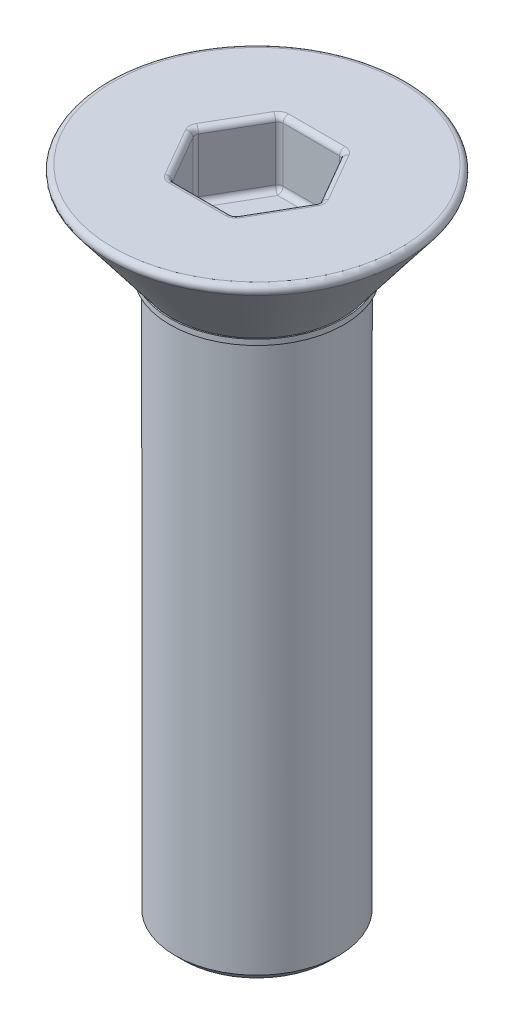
ISO-10303-21;
HEADER;
FILE_DESCRIPTION(('STEP AP214'),'2;1');
FILE_NAME('part.step','',(''),(''),'','','');
FILE_SCHEMA(('AUTOMOTIVE_DESIGN { 1 0 10303 214 1 1 1 1 }'));
ENDSEC;
DATA;
#1=APPLICATION_CONTEXT('core data for automotive mechanical design processes');
#2=APPLICATION_PROTOCOL_DEFINITION('international standard','automotive_design',2000,#1);
#3=PRODUCT_CONTEXT('',#1,'mechanical');
#4=PRODUCT('Part','Part','',(#3));
#5=PRODUCT_RELATED_PRODUCT_CATEGORY('part','',(#4));
#6=PRODUCT_DEFINITION_FORMATION('','',#4);
#7=PRODUCT_DEFINITION_CONTEXT('part definition',#1,'design');
#8=PRODUCT_DEFINITION('design','',#6,#7);
#9=PRODUCT_DEFINITION_SHAPE('','',#8);
#10=(LENGTH_UNIT() NAMED_UNIT(*) SI_UNIT(.MILLI.,.METRE.));
#11=(NAMED_UNIT(*) PLANE_ANGLE_UNIT() SI_UNIT($,.RADIAN.));
#12=(NAMED_UNIT(*) SI_UNIT($,.STERADIAN.) SOLID_ANGLE_UNIT());
#13=UNCERTAINTY_MEASURE_WITH_UNIT(LENGTH_MEASURE(1.E-05),#10,'distance_accuracy_value','');
#14=(GEOMETRIC_REPRESENTATION_CONTEXT(3) GLOBAL_UNCERTAINTY_ASSIGNED_CONTEXT((#13)) GLOBAL_UNIT_ASSIGNED_CONTEXT((#10,
#11,#12)) REPRESENTATION_CONTEXT('',''));
#15=CARTESIAN_POINT('',(0.,0.,0.));
#16=DIRECTION('',(0.,0.,1.));
#17=DIRECTION('',(1.,0.,0.));
#18=AXIS2_PLACEMENT_3D('',#15,#16,#17);
#19=CARTESIAN_POINT('',(0.,0.1,0.));
#20=DIRECTION('',(0.,-1.,0.));
#21=DIRECTION('',(0.,0.,-1.));
#22=AXIS2_PLACEMENT_3D('',#19,#20,#21);
#23=CYLINDRICAL_SURFACE('',#22,1.6);
#24=CARTESIAN_POINT('',(0.,0.1,0.));
#25=DIRECTION('',(0.,1.,0.));
#26=DIRECTION('',(0.,0.,1.));
#27=AXIS2_PLACEMENT_3D('',#24,#25,#26);
#28=CIRCLE('',#27,1.6);
#29=CARTESIAN_POINT('',(0.,0.0999999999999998,1.6));
#30=VERTEX_POINT('',#29);
#31=EDGE_CURVE('E11',#30,#30,#28,.T.);
#32=ORIENTED_EDGE('',*,*,#31,.F.);
#33=EDGE_LOOP('',(#32));
#34=FACE_BOUND('',#33,.T.);
#35=CARTESIAN_POINT('',(0.,0.,0.));
#36=DIRECTION('',(0.,1.,0.));
#37=DIRECTION('',(0.,0.,1.));
#38=AXIS2_PLACEMENT_3D('',#35,#36,#37);
#39=CIRCLE('',#38,1.6);
#40=CARTESIAN_POINT('',(0.,0.,1.6));
#41=VERTEX_POINT('',#40);
#42=EDGE_CURVE('E48',#41,#41,#39,.T.);
#43=ORIENTED_EDGE('',*,*,#42,.T.);
#44=EDGE_LOOP('',(#43));
#45=FACE_BOUND('',#44,.T.);
#46=ADVANCED_FACE('F45',(#34,#45),#23,.T.);
#47=CARTESIAN_POINT('',(0.,0.1,0.));
#48=DIRECTION('',(0.,1.,0.));
#49=DIRECTION('',(0.,0.,1.));
#50=AXIS2_PLACEMENT_3D('',#47,#48,#49);
#51=PLANE('',#50);
#52=ORIENTED_EDGE('',*,*,#31,.T.);
#53=EDGE_LOOP('',(#52));
#54=FACE_BOUND('',#53,.T.);
#55=ADVANCED_FACE('F60',(#54),#51,.T.);
#56=CARTESIAN_POINT('',(0.,0.,0.));
#57=DIRECTION('',(0.,1.,0.));
#58=DIRECTION('',(0.,0.,1.));
#59=AXIS2_PLACEMENT_3D('',#56,#57,#58);
#60=PLANE('',#59);
#61=ORIENTED_EDGE('',*,*,#42,.F.);
#62=EDGE_LOOP('',(#61));
#63=FACE_BOUND('',#62,.T.);
#64=ADVANCED_FACE('F58',(#63),#60,.F.);
#65=CLOSED_SHELL('',(#46,#55,#64));
#66=MANIFOLD_SOLID_BREP('B2',#65);
#67=CARTESIAN_POINT('',(0.,1.75,2.845));
#68=DIRECTION('',(0.,1.,0.));
#69=DIRECTION('',(0.,0.,1.));
#70=AXIS2_PLACEMENT_3D('',#67,#68,#69);
#71=PLANE('',#70);
#72=CARTESIAN_POINT('',(0.,1.75,0.));
#73=DIRECTION('',(0.,1.,0.));
#74=DIRECTION('',(0.,0.,1.));
#75=AXIS2_PLACEMENT_3D('',#72,#73,#74);
#76=CIRCLE('',#75,2.6420198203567);
#77=CARTESIAN_POINT('',(0.,1.75,2.6420198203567));
#78=VERTEX_POINT('',#77);
#79=EDGE_CURVE('E288',#78,#78,#76,.T.);
#80=ORIENTED_EDGE('',*,*,#79,.T.);
#81=EDGE_LOOP('',(#80));
#82=FACE_BOUND('',#81,.T.);
#83=CARTESIAN_POINT('',(0.519615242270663,1.75,0.9));
#84=DIRECTION('',(0.,1.,0.));
#85=DIRECTION('',(0.,0.,1.));
#86=AXIS2_PLACEMENT_3D('',#83,#84,#85);
#87=CIRCLE('',#86,0.2);
#88=CARTESIAN_POINT('',(0.519615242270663,1.75,1.1));
#89=VERTEX_POINT('',#88);
#90=CARTESIAN_POINT('',(0.692820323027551,1.75,1.));
#91=VERTEX_POINT('',#90);
#92=EDGE_CURVE('E318',#89,#91,#87,.T.);
#93=ORIENTED_EDGE('',*,*,#92,.F.);
#94=DIRECTION('',(1.,0.,0.));
#95=VECTOR('',#94,1.);
#96=CARTESIAN_POINT('',(-0.577350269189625,1.75,1.1));
#97=LINE('',#96,#95);
#98=CARTESIAN_POINT('',(-0.519615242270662,1.75,1.1));
#99=VERTEX_POINT('',#98);
#100=EDGE_CURVE('E316',#89,#99,#97,.F.);
#101=ORIENTED_EDGE('',*,*,#100,.T.);
#102=CARTESIAN_POINT('',(-0.519615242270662,1.75,0.900000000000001));
#103=DIRECTION('',(0.,1.,0.));
#104=DIRECTION('',(0.,0.,1.));
#105=AXIS2_PLACEMENT_3D('',#102,#103,#104);
#106=CIRCLE('',#105,0.2);
#107=CARTESIAN_POINT('',(-0.69282032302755,1.75,1.));
#108=VERTEX_POINT('',#107);
#109=EDGE_CURVE('E313',#108,#99,#106,.T.);
#110=ORIENTED_EDGE('',*,*,#109,.F.);
#111=DIRECTION('',(0.5,0.,0.866025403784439));
#112=VECTOR('',#111,1.);
#113=CARTESIAN_POINT('',(-1.2413030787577,1.75,0.0500000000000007));
#114=LINE('',#113,#112);
#115=CARTESIAN_POINT('',(-1.21243556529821,1.75,0.100000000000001));
#116=VERTEX_POINT('',#115);
#117=EDGE_CURVE('E305',#108,#116,#114,.F.);
#118=ORIENTED_EDGE('',*,*,#117,.T.);
#119=CARTESIAN_POINT('',(-1.03923048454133,1.75,0.));
#120=DIRECTION('',(0.,1.,0.));
#121=DIRECTION('',(0.,0.,1.));
#122=AXIS2_PLACEMENT_3D('',#119,#120,#121);
#123=CIRCLE('',#122,0.2);
#124=CARTESIAN_POINT('',(-1.21243556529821,1.75,-0.0999999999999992));
#125=VERTEX_POINT('',#124);
#126=EDGE_CURVE('E303',#125,#116,#123,.T.);
#127=ORIENTED_EDGE('',*,*,#126,.F.);
#128=DIRECTION('',(-0.5,0.,0.866025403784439));
#129=VECTOR('',#128,1.);
#130=CARTESIAN_POINT('',(-0.66395280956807,1.75,-1.05));
#131=LINE('',#130,#129);
#132=CARTESIAN_POINT('',(-0.692820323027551,1.75,-1.));
#133=VERTEX_POINT('',#132);
#134=EDGE_CURVE('E299',#125,#133,#131,.F.);
#135=ORIENTED_EDGE('',*,*,#134,.T.);
#136=CARTESIAN_POINT('',(-0.519615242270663,1.75,-0.9));
#137=DIRECTION('',(0.,1.,0.));
#138=DIRECTION('',(0.,0.,1.));
#139=AXIS2_PLACEMENT_3D('',#136,#137,#138);
#140=CIRCLE('',#139,0.2);
#141=CARTESIAN_POINT('',(-0.519615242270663,1.75,-1.1));
#142=VERTEX_POINT('',#141);
#143=EDGE_CURVE('E296',#142,#133,#140,.T.);
#144=ORIENTED_EDGE('',*,*,#143,.F.);
#145=DIRECTION('',(-1.,0.,0.));
#146=VECTOR('',#145,1.);
#147=CARTESIAN_POINT('',(0.577350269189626,1.75,-1.1));
#148=LINE('',#147,#146);
#149=CARTESIAN_POINT('',(0.519615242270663,1.75,-1.1));
#150=VERTEX_POINT('',#149);
#151=EDGE_CURVE('E294',#142,#150,#148,.F.);
#152=ORIENTED_EDGE('',*,*,#151,.T.);
#153=CARTESIAN_POINT('',(0.519615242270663,1.75,-0.9));
#154=DIRECTION('',(0.,1.,0.));
#155=DIRECTION('',(0.,0.,1.));
#156=AXIS2_PLACEMENT_3D('',#153,#154,#155);
#157=CIRCLE('',#156,0.2);
#158=CARTESIAN_POINT('',(0.692820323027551,1.75,-1.));
#159=VERTEX_POINT('',#158);
#160=EDGE_CURVE('E291',#159,#150,#157,.T.);
#161=ORIENTED_EDGE('',*,*,#160,.F.);
#162=DIRECTION('',(-0.5,0.,-0.866025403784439));
#163=VECTOR('',#162,1.);
#164=CARTESIAN_POINT('',(1.2413030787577,1.75,-0.0500000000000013));
#165=LINE('',#164,#163);
#166=CARTESIAN_POINT('',(1.21243556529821,1.75,-0.100000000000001));
#167=VERTEX_POINT('',#166);
#168=EDGE_CURVE('E301',#159,#167,#165,.F.);
#169=ORIENTED_EDGE('',*,*,#168,.T.);
#170=CARTESIAN_POINT('',(1.03923048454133,1.75,0.));
#171=DIRECTION('',(0.,1.,0.));
#172=DIRECTION('',(0.,0.,1.));
#173=AXIS2_PLACEMENT_3D('',#170,#171,#172);
#174=CIRCLE('',#173,0.2);
#175=CARTESIAN_POINT('',(1.21243556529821,1.75,0.099999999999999));
#176=VERTEX_POINT('',#175);
#177=EDGE_CURVE('E308',#176,#167,#174,.T.);
#178=ORIENTED_EDGE('',*,*,#177,.F.);
#179=DIRECTION('',(0.499999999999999,0.,-0.866025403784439));
#180=VECTOR('',#179,1.);
#181=CARTESIAN_POINT('',(0.66395280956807,1.75,1.05));
#182=LINE('',#181,#180);
#183=EDGE_CURVE('E311',#176,#91,#182,.F.);
#184=ORIENTED_EDGE('',*,*,#183,.T.);
#185=EDGE_LOOP('',(#93,#101,#110,#118,#127,#135,#144,#152,#161,#169,#178,#184));
#186=FACE_BOUND('',#185,.T.);
#187=ADVANCED_FACE('F86',(#82,#186),#71,.T.);
#188=CARTESIAN_POINT('',(0.,-10.25,0.));
#189=DIRECTION('',(0.,-1.,0.));
#190=DIRECTION('',(0.,0.,-1.));
#191=AXIS2_PLACEMENT_3D('',#188,#189,#190);
#192=PLANE('',#191);
#193=CARTESIAN_POINT('',(0.,-10.25,0.));
#194=DIRECTION('',(0.,-1.,0.));
#195=DIRECTION('',(0.,0.,-1.));
#196=AXIS2_PLACEMENT_3D('',#193,#194,#195);
#197=CIRCLE('',#196,1.35000000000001);
#198=CARTESIAN_POINT('',(0.,-10.25,-1.35000000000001));
#199=VERTEX_POINT('',#198);
#200=EDGE_CURVE('E265',#199,#199,#197,.T.);
#201=ORIENTED_EDGE('',*,*,#200,.T.);
#202=EDGE_LOOP('',(#201));
#203=FACE_BOUND('',#202,.T.);
#204=ADVANCED_FACE('F480',(#203),#192,.T.);
#205=CARTESIAN_POINT('',(0.,1.75,0.));
#206=DIRECTION('',(0.,1.,0.));
#207=DIRECTION('',(0.,0.,1.));
#208=AXIS2_PLACEMENT_3D('',#205,#206,#207);
#209=CYLINDRICAL_SURFACE('',#208,1.5);
#210=CARTESIAN_POINT('',(0.,-10.1,0.));
#211=DIRECTION('',(0.,-1.,0.));
#212=DIRECTION('',(0.,0.,-1.));
#213=AXIS2_PLACEMENT_3D('',#210,#211,#212);
#214=CIRCLE('',#213,1.5);
#215=CARTESIAN_POINT('',(0.,-10.1,-1.5));
#216=VERTEX_POINT('',#215);
#217=EDGE_CURVE('E269',#216,#216,#214,.F.);
#218=ORIENTED_EDGE('',*,*,#217,.T.);
#219=EDGE_LOOP('',(#218));
#220=FACE_BOUND('',#219,.T.);
#221=CARTESIAN_POINT('',(0.,0.,0.));
#222=DIRECTION('',(0.,1.,0.));
#223=DIRECTION('',(0.,0.,1.));
#224=AXIS2_PLACEMENT_3D('',#221,#222,#223);
#225=CIRCLE('',#224,1.5);
#226=CARTESIAN_POINT('',(0.,0.,1.5));
#227=VERTEX_POINT('',#226);
#228=EDGE_CURVE('E449',#227,#227,#225,.T.);
#229=ORIENTED_EDGE('',*,*,#228,.F.);
#230=EDGE_LOOP('',(#229));
#231=FACE_BOUND('',#230,.T.);
#232=ADVANCED_FACE('F460',(#220,#231),#209,.T.);
#233=CARTESIAN_POINT('',(0.,1.75,0.));
#234=DIRECTION('',(0.,1.,0.));
#235=DIRECTION('',(0.,0.,1.));
#236=AXIS2_PLACEMENT_3D('',#233,#234,#235);
#237=CONICAL_SURFACE('',#236,2.845,0.655281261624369);
#238=CARTESIAN_POINT('',(0.,1.58906177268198,0.));
#239=DIRECTION('',(0.,-1.,0.));
#240=DIRECTION('',(0.,0.,-1.));
#241=AXIS2_PLACEMENT_3D('',#238,#239,#240);
#242=CIRCLE('',#241,2.72130747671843);
#243=CARTESIAN_POINT('',(0.,1.58906177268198,-2.72130747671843));
#244=VERTEX_POINT('',#243);
#245=EDGE_CURVE('E43',#244,#244,#242,.T.);
#246=ORIENTED_EDGE('',*,*,#245,.T.);
#247=EDGE_LOOP('',(#246));
#248=FACE_BOUND('',#247,.T.);
#249=ORIENTED_EDGE('',*,*,#228,.T.);
#250=EDGE_LOOP('',(#249));
#251=FACE_BOUND('',#250,.T.);
#252=ADVANCED_FACE('F492',(#248,#251),#237,.T.);
#253=CARTESIAN_POINT('',(0.577350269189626,0.550000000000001,1.));
#254=DIRECTION('',(0.866025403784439,0.,0.499999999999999));
#255=DIRECTION('',(0.499999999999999,0.,-0.866025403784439));
#256=AXIS2_PLACEMENT_3D('',#253,#254,#255);
#257=PLANE('',#256);
#258=DIRECTION('',(0.499999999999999,0.,-0.866025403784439));
#259=VECTOR('',#258,1.);
#260=CARTESIAN_POINT('',(0.577350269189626,0.650000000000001,1.));
#261=LINE('',#260,#259);
#262=CARTESIAN_POINT('',(1.12583302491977,0.650000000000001,0.049999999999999));
#263=VERTEX_POINT('',#262);
#264=CARTESIAN_POINT('',(0.606217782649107,0.650000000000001,0.95));
#265=VERTEX_POINT('',#264);
#266=EDGE_CURVE('E334',#263,#265,#261,.F.);
#267=ORIENTED_EDGE('',*,*,#266,.T.);
#268=DIRECTION('',(0.,1.,0.));
#269=VECTOR('',#268,1.);
#270=CARTESIAN_POINT('',(0.606217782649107,1.75,0.95));
#271=LINE('',#270,#269);
#272=CARTESIAN_POINT('',(0.606217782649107,1.65,0.95));
#273=VERTEX_POINT('',#272);
#274=EDGE_CURVE('E336',#265,#273,#271,.T.);
#275=ORIENTED_EDGE('',*,*,#274,.T.);
#276=DIRECTION('',(0.499999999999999,0.,-0.866025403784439));
#277=VECTOR('',#276,1.);
#278=CARTESIAN_POINT('',(1.15470053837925,1.65,0.));
#279=LINE('',#278,#277);
#280=CARTESIAN_POINT('',(1.12583302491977,1.65,0.0499999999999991));
#281=VERTEX_POINT('',#280);
#282=EDGE_CURVE('E332',#273,#281,#279,.T.);
#283=ORIENTED_EDGE('',*,*,#282,.T.);
#284=DIRECTION('',(0.,1.,0.));
#285=VECTOR('',#284,1.);
#286=CARTESIAN_POINT('',(1.12583302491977,0.550000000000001,0.049999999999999));
#287=LINE('',#286,#285);
#288=EDGE_CURVE('E330',#281,#263,#287,.F.);
#289=ORIENTED_EDGE('',*,*,#288,.T.);
#290=EDGE_LOOP('',(#267,#275,#283,#289));
#291=FACE_BOUND('',#290,.T.);
#292=ADVANCED_FACE('F490',(#291),#257,.F.);
#293=CARTESIAN_POINT('',(-0.577350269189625,0.550000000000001,1.));
#294=DIRECTION('',(0.,0.,1.));
#295=DIRECTION('',(1.,0.,0.));
#296=AXIS2_PLACEMENT_3D('',#293,#294,#295);
#297=PLANE('',#296);
#298=DIRECTION('',(1.,0.,0.));
#299=VECTOR('',#298,1.);
#300=CARTESIAN_POINT('',(-0.577350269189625,0.650000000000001,1.));
#301=LINE('',#300,#299);
#302=CARTESIAN_POINT('',(0.519615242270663,0.650000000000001,1.));
#303=VERTEX_POINT('',#302);
#304=CARTESIAN_POINT('',(-0.519615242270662,0.650000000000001,1.));
#305=VERTEX_POINT('',#304);
#306=EDGE_CURVE('E325',#303,#305,#301,.F.);
#307=ORIENTED_EDGE('',*,*,#306,.T.);
#308=DIRECTION('',(0.,1.,0.));
#309=VECTOR('',#308,1.);
#310=CARTESIAN_POINT('',(-0.519615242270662,1.75,1.));
#311=LINE('',#310,#309);
#312=CARTESIAN_POINT('',(-0.519615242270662,1.65,1.));
#313=VERTEX_POINT('',#312);
#314=EDGE_CURVE('E327',#305,#313,#311,.T.);
#315=ORIENTED_EDGE('',*,*,#314,.T.);
#316=DIRECTION('',(1.,0.,0.));
#317=VECTOR('',#316,1.);
#318=CARTESIAN_POINT('',(0.577350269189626,1.65,1.));
#319=LINE('',#318,#317);
#320=CARTESIAN_POINT('',(0.519615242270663,1.65,1.));
#321=VERTEX_POINT('',#320);
#322=EDGE_CURVE('E323',#313,#321,#319,.T.);
#323=ORIENTED_EDGE('',*,*,#322,.T.);
#324=DIRECTION('',(0.,1.,0.));
#325=VECTOR('',#324,1.);
#326=CARTESIAN_POINT('',(0.519615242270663,0.550000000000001,1.));
#327=LINE('',#326,#325);
#328=EDGE_CURVE('E321',#321,#303,#327,.F.);
#329=ORIENTED_EDGE('',*,*,#328,.T.);
#330=EDGE_LOOP('',(#307,#315,#323,#329));
#331=FACE_BOUND('',#330,.T.);
#332=ADVANCED_FACE('F511',(#331),#297,.F.);
#333=CARTESIAN_POINT('',(-1.15470053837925,0.550000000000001,0.));
#334=DIRECTION('',(-0.866025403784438,0.,0.5));
#335=DIRECTION('',(0.5,0.,0.866025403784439));
#336=AXIS2_PLACEMENT_3D('',#333,#334,#335);
#337=PLANE('',#336);
#338=DIRECTION('',(0.5,0.,0.866025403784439));
#339=VECTOR('',#338,1.);
#340=CARTESIAN_POINT('',(-0.577350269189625,1.65,1.));
#341=LINE('',#340,#339);
#342=CARTESIAN_POINT('',(-1.12583302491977,1.65,0.0500000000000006));
#343=VERTEX_POINT('',#342);
#344=CARTESIAN_POINT('',(-0.606217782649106,1.65,0.950000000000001));
#345=VERTEX_POINT('',#344);
#346=EDGE_CURVE('E281',#343,#345,#341,.T.);
#347=ORIENTED_EDGE('',*,*,#346,.T.);
#348=DIRECTION('',(0.,1.,0.));
#349=VECTOR('',#348,1.);
#350=CARTESIAN_POINT('',(-0.606217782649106,0.550000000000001,0.950000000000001));
#351=LINE('',#350,#349);
#352=CARTESIAN_POINT('',(-0.606217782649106,0.650000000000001,0.950000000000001));
#353=VERTEX_POINT('',#352);
#354=EDGE_CURVE('E286',#345,#353,#351,.F.);
#355=ORIENTED_EDGE('',*,*,#354,.T.);
#356=DIRECTION('',(0.5,0.,0.866025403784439));
#357=VECTOR('',#356,1.);
#358=CARTESIAN_POINT('',(-1.15470053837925,0.650000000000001,0.));
#359=LINE('',#358,#357);
#360=CARTESIAN_POINT('',(-1.12583302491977,0.650000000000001,0.0500000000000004));
#361=VERTEX_POINT('',#360);
#362=EDGE_CURVE('E283',#353,#361,#359,.F.);
#363=ORIENTED_EDGE('',*,*,#362,.T.);
#364=DIRECTION('',(0.,1.,0.));
#365=VECTOR('',#364,1.);
#366=CARTESIAN_POINT('',(-1.12583302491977,1.75,0.0500000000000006));
#367=LINE('',#366,#365);
#368=EDGE_CURVE('E279',#361,#343,#367,.T.);
#369=ORIENTED_EDGE('',*,*,#368,.T.);
#370=EDGE_LOOP('',(#347,#355,#363,#369));
#371=FACE_BOUND('',#370,.T.);
#372=ADVANCED_FACE('F518',(#371),#337,.F.);
#373=CARTESIAN_POINT('',(-0.577350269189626,0.550000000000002,-1.));
#374=DIRECTION('',(-0.866025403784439,0.,-0.5));
#375=DIRECTION('',(-0.5,0.,0.866025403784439));
#376=AXIS2_PLACEMENT_3D('',#373,#374,#375);
#377=PLANE('',#376);
#378=DIRECTION('',(0.,1.,0.));
#379=VECTOR('',#378,1.);
#380=CARTESIAN_POINT('',(-1.12583302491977,0.550000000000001,-0.0499999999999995));
#381=LINE('',#380,#379);
#382=CARTESIAN_POINT('',(-1.12583302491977,1.65,-0.0499999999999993));
#383=VERTEX_POINT('',#382);
#384=CARTESIAN_POINT('',(-1.12583302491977,0.650000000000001,-0.0499999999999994));
#385=VERTEX_POINT('',#384);
#386=EDGE_CURVE('E351',#383,#385,#381,.F.);
#387=ORIENTED_EDGE('',*,*,#386,.T.);
#388=DIRECTION('',(-0.5,0.,0.866025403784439));
#389=VECTOR('',#388,1.);
#390=CARTESIAN_POINT('',(-0.577350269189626,0.650000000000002,-1.));
#391=LINE('',#390,#389);
#392=CARTESIAN_POINT('',(-0.606217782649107,0.650000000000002,-0.95));
#393=VERTEX_POINT('',#392);
#394=EDGE_CURVE('E353',#385,#393,#391,.F.);
#395=ORIENTED_EDGE('',*,*,#394,.T.);
#396=DIRECTION('',(0.,1.,0.));
#397=VECTOR('',#396,1.);
#398=CARTESIAN_POINT('',(-0.606217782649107,1.75,-0.95));
#399=LINE('',#398,#397);
#400=CARTESIAN_POINT('',(-0.606217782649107,1.65,-0.95));
#401=VERTEX_POINT('',#400);
#402=EDGE_CURVE('E347',#393,#401,#399,.T.);
#403=ORIENTED_EDGE('',*,*,#402,.T.);
#404=DIRECTION('',(-0.5,0.,0.866025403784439));
#405=VECTOR('',#404,1.);
#406=CARTESIAN_POINT('',(-1.15470053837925,1.65,0.));
#407=LINE('',#406,#405);
#408=EDGE_CURVE('E349',#401,#383,#407,.T.);
#409=ORIENTED_EDGE('',*,*,#408,.T.);
#410=EDGE_LOOP('',(#387,#395,#403,#409));
#411=FACE_BOUND('',#410,.T.);
#412=ADVANCED_FACE('F526',(#411),#377,.F.);
#413=CARTESIAN_POINT('',(0.577350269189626,0.550000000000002,-1.));
#414=DIRECTION('',(0.,0.,-1.));
#415=DIRECTION('',(-1.,0.,0.));
#416=AXIS2_PLACEMENT_3D('',#413,#414,#415);
#417=PLANE('',#416);
#418=DIRECTION('',(-1.,0.,0.));
#419=VECTOR('',#418,1.);
#420=CARTESIAN_POINT('',(0.577350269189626,0.650000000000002,-1.));
#421=LINE('',#420,#419);
#422=CARTESIAN_POINT('',(-0.519615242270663,0.650000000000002,-1.));
#423=VERTEX_POINT('',#422);
#424=CARTESIAN_POINT('',(0.519615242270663,0.650000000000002,-1.));
#425=VERTEX_POINT('',#424);
#426=EDGE_CURVE('E103',#423,#425,#421,.F.);
#427=ORIENTED_EDGE('',*,*,#426,.T.);
#428=DIRECTION('',(0.,1.,0.));
#429=VECTOR('',#428,1.);
#430=CARTESIAN_POINT('',(0.519615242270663,1.75,-1.));
#431=LINE('',#430,#429);
#432=CARTESIAN_POINT('',(0.519615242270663,1.65,-1.));
#433=VERTEX_POINT('',#432);
#434=EDGE_CURVE('E95',#425,#433,#431,.T.);
#435=ORIENTED_EDGE('',*,*,#434,.T.);
#436=DIRECTION('',(-1.,0.,0.));
#437=VECTOR('',#436,1.);
#438=CARTESIAN_POINT('',(-0.577350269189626,1.65,-1.));
#439=LINE('',#438,#437);
#440=CARTESIAN_POINT('',(-0.519615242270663,1.65,-1.));
#441=VERTEX_POINT('',#440);
#442=EDGE_CURVE('E356',#433,#441,#439,.T.);
#443=ORIENTED_EDGE('',*,*,#442,.T.);
#444=DIRECTION('',(0.,1.,0.));
#445=VECTOR('',#444,1.);
#446=CARTESIAN_POINT('',(-0.519615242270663,0.550000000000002,-1.));
#447=LINE('',#446,#445);
#448=EDGE_CURVE('E108',#441,#423,#447,.F.);
#449=ORIENTED_EDGE('',*,*,#448,.T.);
#450=EDGE_LOOP('',(#427,#435,#443,#449));
#451=FACE_BOUND('',#450,.T.);
#452=ADVANCED_FACE('F534',(#451),#417,.F.);
#453=CARTESIAN_POINT('',(1.15470053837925,0.550000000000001,0.));
#454=DIRECTION('',(0.866025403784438,0.,-0.5));
#455=DIRECTION('',(-0.5,0.,-0.866025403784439));
#456=AXIS2_PLACEMENT_3D('',#453,#454,#455);
#457=PLANE('',#456);
#458=DIRECTION('',(-0.5,0.,-0.866025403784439));
#459=VECTOR('',#458,1.);
#460=CARTESIAN_POINT('',(1.15470053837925,0.650000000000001,0.));
#461=LINE('',#460,#459);
#462=CARTESIAN_POINT('',(0.606217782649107,0.650000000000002,-0.95));
#463=VERTEX_POINT('',#462);
#464=CARTESIAN_POINT('',(1.12583302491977,0.650000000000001,-0.0500000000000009));
#465=VERTEX_POINT('',#464);
#466=EDGE_CURVE('E247',#463,#465,#461,.F.);
#467=ORIENTED_EDGE('',*,*,#466,.T.);
#468=DIRECTION('',(0.,1.,0.));
#469=VECTOR('',#468,1.);
#470=CARTESIAN_POINT('',(1.12583302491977,1.75,-0.0500000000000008));
#471=LINE('',#470,#469);
#472=CARTESIAN_POINT('',(1.12583302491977,1.65,-0.0500000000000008));
#473=VERTEX_POINT('',#472);
#474=EDGE_CURVE('E344',#465,#473,#471,.T.);
#475=ORIENTED_EDGE('',*,*,#474,.T.);
#476=DIRECTION('',(-0.5,0.,-0.866025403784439));
#477=VECTOR('',#476,1.);
#478=CARTESIAN_POINT('',(0.577350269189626,1.65,-1.));
#479=LINE('',#478,#477);
#480=CARTESIAN_POINT('',(0.606217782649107,1.65,-0.95));
#481=VERTEX_POINT('',#480);
#482=EDGE_CURVE('E341',#473,#481,#479,.T.);
#483=ORIENTED_EDGE('',*,*,#482,.T.);
#484=DIRECTION('',(0.,1.,0.));
#485=VECTOR('',#484,1.);
#486=CARTESIAN_POINT('',(0.606217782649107,0.550000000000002,-0.95));
#487=LINE('',#486,#485);
#488=EDGE_CURVE('E339',#481,#463,#487,.F.);
#489=ORIENTED_EDGE('',*,*,#488,.T.);
#490=EDGE_LOOP('',(#467,#475,#483,#489));
#491=FACE_BOUND('',#490,.T.);
#492=ADVANCED_FACE('F474',(#491),#457,.F.);
#493=CARTESIAN_POINT('',(0.,0.550000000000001,0.));
#494=DIRECTION('',(0.,1.,0.));
#495=DIRECTION('',(0.,0.,1.));
#496=AXIS2_PLACEMENT_3D('',#493,#494,#495);
#497=PLANE('',#496);
#498=DIRECTION('',(-0.5,0.,0.866025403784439));
#499=VECTOR('',#498,1.);
#500=CARTESIAN_POINT('',(-0.779422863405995,0.550000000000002,-0.449999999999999));
#501=LINE('',#500,#499);
#502=CARTESIAN_POINT('',(-0.519615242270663,0.550000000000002,-0.9));
#503=VERTEX_POINT('',#502);
#504=CARTESIAN_POINT('',(-1.03923048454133,0.550000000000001,0.));
#505=VERTEX_POINT('',#504);
#506=EDGE_CURVE('E240',#503,#505,#501,.T.);
#507=ORIENTED_EDGE('',*,*,#506,.T.);
#508=DIRECTION('',(0.5,0.,0.866025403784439));
#509=VECTOR('',#508,1.);
#510=CARTESIAN_POINT('',(-0.779422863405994,0.550000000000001,0.45));
#511=LINE('',#510,#509);
#512=CARTESIAN_POINT('',(-0.519615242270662,0.550000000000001,0.900000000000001));
#513=VERTEX_POINT('',#512);
#514=EDGE_CURVE('E276',#505,#513,#511,.T.);
#515=ORIENTED_EDGE('',*,*,#514,.T.);
#516=DIRECTION('',(1.,0.,0.));
#517=VECTOR('',#516,1.);
#518=CARTESIAN_POINT('',(0.,0.550000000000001,0.9));
#519=LINE('',#518,#517);
#520=CARTESIAN_POINT('',(0.519615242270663,0.550000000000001,0.9));
#521=VERTEX_POINT('',#520);
#522=EDGE_CURVE('E274',#513,#521,#519,.T.);
#523=ORIENTED_EDGE('',*,*,#522,.T.);
#524=DIRECTION('',(0.499999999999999,0.,-0.866025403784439));
#525=VECTOR('',#524,1.);
#526=CARTESIAN_POINT('',(0.779422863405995,0.550000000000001,0.449999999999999));
#527=LINE('',#526,#525);
#528=CARTESIAN_POINT('',(1.03923048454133,0.550000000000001,0.));
#529=VERTEX_POINT('',#528);
#530=EDGE_CURVE('E236',#521,#529,#527,.T.);
#531=ORIENTED_EDGE('',*,*,#530,.T.);
#532=DIRECTION('',(-0.5,0.,-0.866025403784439));
#533=VECTOR('',#532,1.);
#534=CARTESIAN_POINT('',(0.779422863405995,0.550000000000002,-0.45));
#535=LINE('',#534,#533);
#536=CARTESIAN_POINT('',(0.519615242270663,0.550000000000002,-0.9));
#537=VERTEX_POINT('',#536);
#538=EDGE_CURVE('E229',#529,#537,#535,.T.);
#539=ORIENTED_EDGE('',*,*,#538,.T.);
#540=DIRECTION('',(-1.,0.,0.));
#541=VECTOR('',#540,1.);
#542=CARTESIAN_POINT('',(0.,0.550000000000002,-0.9));
#543=LINE('',#542,#541);
#544=EDGE_CURVE('E233',#537,#503,#543,.T.);
#545=ORIENTED_EDGE('',*,*,#544,.T.);
#546=EDGE_LOOP('',(#507,#515,#523,#531,#539,#545));
#547=FACE_BOUND('',#546,.T.);
#548=ADVANCED_FACE('F231',(#547),#497,.T.);
#549=CARTESIAN_POINT('',(0.,-10.1,0.));
#550=DIRECTION('',(0.,1.,0.));
#551=DIRECTION('',(0.,0.,1.));
#552=AXIS2_PLACEMENT_3D('',#549,#550,#551);
#553=CONICAL_SURFACE('',#552,1.5,0.78539816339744);
#554=ORIENTED_EDGE('',*,*,#200,.F.);
#555=EDGE_LOOP('',(#554));
#556=FACE_BOUND('',#555,.T.);
#557=ORIENTED_EDGE('',*,*,#217,.F.);
#558=EDGE_LOOP('',(#557));
#559=FACE_BOUND('',#558,.T.);
#560=ADVANCED_FACE('F463',(#556,#559),#553,.T.);
#561=CARTESIAN_POINT('',(1.2413030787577,1.65,-0.0500000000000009));
#562=DIRECTION('',(0.5,0.,0.866025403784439));
#563=DIRECTION('',(0.866025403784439,0.,-0.5));
#564=AXIS2_PLACEMENT_3D('',#561,#562,#563);
#565=CYLINDRICAL_SURFACE('',#564,0.1);
#566=CARTESIAN_POINT('',(1.21243556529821,1.65,-0.100000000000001));
#567=DIRECTION('',(0.5,0.,0.866025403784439));
#568=DIRECTION('',(0.866025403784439,0.,-0.5));
#569=AXIS2_PLACEMENT_3D('',#566,#567,#568);
#570=CIRCLE('',#569,0.1);
#571=EDGE_CURVE('E442',#167,#473,#570,.T.);
#572=ORIENTED_EDGE('',*,*,#571,.F.);
#573=ORIENTED_EDGE('',*,*,#168,.F.);
#574=CARTESIAN_POINT('',(0.692820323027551,1.65,-1.));
#575=DIRECTION('',(-0.5,0.,-0.866025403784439));
#576=DIRECTION('',(-0.866025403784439,0.,0.5));
#577=AXIS2_PLACEMENT_3D('',#574,#575,#576);
#578=CIRCLE('',#577,0.1);
#579=EDGE_CURVE('E90',#481,#159,#578,.T.);
#580=ORIENTED_EDGE('',*,*,#579,.F.);
#581=ORIENTED_EDGE('',*,*,#482,.F.);
#582=EDGE_LOOP('',(#572,#573,#580,#581));
#583=FACE_BOUND('',#582,.T.);
#584=ADVANCED_FACE('F465',(#583),#565,.T.);
#585=CARTESIAN_POINT('',(0.519615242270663,1.65,-0.9));
#586=DIRECTION('',(0.,1.,0.));
#587=DIRECTION('',(0.,0.,1.));
#588=AXIS2_PLACEMENT_3D('',#585,#586,#587);
#589=TOROIDAL_SURFACE('',#588,0.2,0.1);
#590=ORIENTED_EDGE('',*,*,#579,.T.);
#591=ORIENTED_EDGE('',*,*,#160,.T.);
#592=CARTESIAN_POINT('',(0.519615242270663,1.65,-1.1));
#593=DIRECTION('',(1.,0.,0.));
#594=DIRECTION('',(0.,0.,-1.));
#595=AXIS2_PLACEMENT_3D('',#592,#593,#594);
#596=CIRCLE('',#595,0.1);
#597=EDGE_CURVE('E440',#433,#150,#596,.F.);
#598=ORIENTED_EDGE('',*,*,#597,.F.);
#599=CARTESIAN_POINT('',(0.519615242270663,1.65,-0.9));
#600=DIRECTION('',(0.,1.,0.));
#601=DIRECTION('',(0.,0.,1.));
#602=AXIS2_PLACEMENT_3D('',#599,#600,#601);
#603=CIRCLE('',#602,0.1);
#604=EDGE_CURVE('E437',#481,#433,#603,.T.);
#605=ORIENTED_EDGE('',*,*,#604,.F.);
#606=EDGE_LOOP('',(#590,#591,#598,#605));
#607=FACE_BOUND('',#606,.T.);
#608=ADVANCED_FACE('F472',(#607),#589,.T.);
#609=CARTESIAN_POINT('',(1.03923048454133,1.65,0.));
#610=DIRECTION('',(0.,1.,0.));
#611=DIRECTION('',(0.,0.,1.));
#612=AXIS2_PLACEMENT_3D('',#609,#610,#611);
#613=TOROIDAL_SURFACE('',#612,0.2,0.1);
#614=ORIENTED_EDGE('',*,*,#177,.T.);
#615=ORIENTED_EDGE('',*,*,#571,.T.);
#616=CARTESIAN_POINT('',(1.03923048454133,1.65,0.));
#617=DIRECTION('',(0.,1.,0.));
#618=DIRECTION('',(0.,0.,1.));
#619=AXIS2_PLACEMENT_3D('',#616,#617,#618);
#620=CIRCLE('',#619,0.1);
#621=EDGE_CURVE('E435',#281,#473,#620,.T.);
#622=ORIENTED_EDGE('',*,*,#621,.F.);
#623=CARTESIAN_POINT('',(1.21243556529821,1.65,0.099999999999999));
#624=DIRECTION('',(0.499999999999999,0.,-0.866025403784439));
#625=DIRECTION('',(-0.866025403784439,0.,-0.499999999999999));
#626=AXIS2_PLACEMENT_3D('',#623,#624,#625);
#627=CIRCLE('',#626,0.1);
#628=EDGE_CURVE('E432',#176,#281,#627,.F.);
#629=ORIENTED_EDGE('',*,*,#628,.F.);
#630=EDGE_LOOP('',(#614,#615,#622,#629));
#631=FACE_BOUND('',#630,.T.);
#632=ADVANCED_FACE('F569',(#631),#613,.T.);
#633=CARTESIAN_POINT('',(0.577350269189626,1.65,-1.1));
#634=DIRECTION('',(1.,0.,0.));
#635=DIRECTION('',(0.,0.,-1.));
#636=AXIS2_PLACEMENT_3D('',#633,#634,#635);
#637=CYLINDRICAL_SURFACE('',#636,0.1);
#638=ORIENTED_EDGE('',*,*,#597,.T.);
#639=ORIENTED_EDGE('',*,*,#151,.F.);
#640=CARTESIAN_POINT('',(-0.519615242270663,1.65,-1.1));
#641=DIRECTION('',(-1.,0.,0.));
#642=DIRECTION('',(0.,0.,1.));
#643=AXIS2_PLACEMENT_3D('',#640,#641,#642);
#644=CIRCLE('',#643,0.1);
#645=EDGE_CURVE('E429',#441,#142,#644,.T.);
#646=ORIENTED_EDGE('',*,*,#645,.F.);
#647=ORIENTED_EDGE('',*,*,#442,.F.);
#648=EDGE_LOOP('',(#638,#639,#646,#647));
#649=FACE_BOUND('',#648,.T.);
#650=ADVANCED_FACE('F578',(#649),#637,.T.);
#651=CARTESIAN_POINT('',(0.519615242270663,0.550000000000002,-0.9));
#652=DIRECTION('',(0.,-1.,0.));
#653=DIRECTION('',(0.,0.,-1.));
#654=AXIS2_PLACEMENT_3D('',#651,#652,#653);
#655=CYLINDRICAL_SURFACE('',#654,0.1);
#656=ORIENTED_EDGE('',*,*,#604,.T.);
#657=ORIENTED_EDGE('',*,*,#434,.F.);
#658=CARTESIAN_POINT('',(0.519615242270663,0.650000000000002,-0.9));
#659=DIRECTION('',(0.,1.,0.));
#660=DIRECTION('',(0.,0.,1.));
#661=AXIS2_PLACEMENT_3D('',#658,#659,#660);
#662=CIRCLE('',#661,0.1);
#663=EDGE_CURVE('E251',#463,#425,#662,.T.);
#664=ORIENTED_EDGE('',*,*,#663,.F.);
#665=ORIENTED_EDGE('',*,*,#488,.F.);
#666=EDGE_LOOP('',(#656,#657,#664,#665));
#667=FACE_BOUND('',#666,.T.);
#668=ADVANCED_FACE('F587',(#667),#655,.F.);
#669=CARTESIAN_POINT('',(0.779422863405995,0.650000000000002,-0.45));
#670=DIRECTION('',(-0.5,0.,-0.866025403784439));
#671=DIRECTION('',(-0.866025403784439,0.,0.5));
#672=AXIS2_PLACEMENT_3D('',#669,#670,#671);
#673=CYLINDRICAL_SURFACE('',#672,0.1);
#674=CARTESIAN_POINT('',(1.03923048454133,0.650000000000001,0.));
#675=DIRECTION('',(-0.5,0.,-0.866025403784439));
#676=DIRECTION('',(-0.866025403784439,0.,0.5));
#677=AXIS2_PLACEMENT_3D('',#674,#675,#676);
#678=CIRCLE('',#677,0.1);
#679=EDGE_CURVE('E252',#465,#529,#678,.T.);
#680=ORIENTED_EDGE('',*,*,#679,.F.);
#681=ORIENTED_EDGE('',*,*,#466,.F.);
#682=CARTESIAN_POINT('',(0.519615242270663,0.650000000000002,-0.9));
#683=DIRECTION('',(0.5,0.,0.866025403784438));
#684=DIRECTION('',(0.866025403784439,0.,-0.5));
#685=AXIS2_PLACEMENT_3D('',#682,#683,#684);
#686=CIRCLE('',#685,0.1);
#687=EDGE_CURVE('E244',#537,#463,#686,.T.);
#688=ORIENTED_EDGE('',*,*,#687,.F.);
#689=ORIENTED_EDGE('',*,*,#538,.F.);
#690=EDGE_LOOP('',(#680,#681,#688,#689));
#691=FACE_BOUND('',#690,.T.);
#692=ADVANCED_FACE('F246',(#691),#673,.F.);
#693=CARTESIAN_POINT('',(1.03923048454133,0.550000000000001,0.));
#694=DIRECTION('',(0.,-1.,0.));
#695=DIRECTION('',(0.,0.,-1.));
#696=AXIS2_PLACEMENT_3D('',#693,#694,#695);
#697=CYLINDRICAL_SURFACE('',#696,0.1);
#698=ORIENTED_EDGE('',*,*,#621,.T.);
#699=ORIENTED_EDGE('',*,*,#474,.F.);
#700=CARTESIAN_POINT('',(1.03923048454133,0.650000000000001,0.));
#701=DIRECTION('',(0.,1.,0.));
#702=DIRECTION('',(0.,0.,1.));
#703=AXIS2_PLACEMENT_3D('',#700,#701,#702);
#704=CIRCLE('',#703,0.1);
#705=EDGE_CURVE('E424',#263,#465,#704,.T.);
#706=ORIENTED_EDGE('',*,*,#705,.F.);
#707=ORIENTED_EDGE('',*,*,#288,.F.);
#708=EDGE_LOOP('',(#698,#699,#706,#707));
#709=FACE_BOUND('',#708,.T.);
#710=ADVANCED_FACE('F606',(#709),#697,.F.);
#711=CARTESIAN_POINT('',(0.66395280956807,1.65,1.05));
#712=DIRECTION('',(-0.499999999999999,0.,0.866025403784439));
#713=DIRECTION('',(0.866025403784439,0.,0.499999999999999));
#714=AXIS2_PLACEMENT_3D('',#711,#712,#713);
#715=CYLINDRICAL_SURFACE('',#714,0.1);
#716=ORIENTED_EDGE('',*,*,#628,.T.);
#717=ORIENTED_EDGE('',*,*,#282,.F.);
#718=CARTESIAN_POINT('',(0.692820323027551,1.65,1.));
#719=DIRECTION('',(-0.5,0.,0.866025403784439));
#720=DIRECTION('',(0.866025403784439,0.,0.5));
#721=AXIS2_PLACEMENT_3D('',#718,#719,#720);
#722=CIRCLE('',#721,0.1);
#723=EDGE_CURVE('E421',#91,#273,#722,.T.);
#724=ORIENTED_EDGE('',*,*,#723,.F.);
#725=ORIENTED_EDGE('',*,*,#183,.F.);
#726=EDGE_LOOP('',(#716,#717,#724,#725));
#727=FACE_BOUND('',#726,.T.);
#728=ADVANCED_FACE('F615',(#727),#715,.T.);
#729=CARTESIAN_POINT('',(-0.519615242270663,1.65,-0.9));
#730=DIRECTION('',(0.,1.,0.));
#731=DIRECTION('',(0.,0.,1.));
#732=AXIS2_PLACEMENT_3D('',#729,#730,#731);
#733=TOROIDAL_SURFACE('',#732,0.2,0.1);
#734=ORIENTED_EDGE('',*,*,#645,.T.);
#735=ORIENTED_EDGE('',*,*,#143,.T.);
#736=CARTESIAN_POINT('',(-0.692820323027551,1.65,-1.));
#737=DIRECTION('',(0.5,0.,-0.866025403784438));
#738=DIRECTION('',(-0.866025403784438,0.,-0.5));
#739=AXIS2_PLACEMENT_3D('',#736,#737,#738);
#740=CIRCLE('',#739,0.1);
#741=EDGE_CURVE('E418',#401,#133,#740,.F.);
#742=ORIENTED_EDGE('',*,*,#741,.F.);
#743=CARTESIAN_POINT('',(-0.519615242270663,1.65,-0.9));
#744=DIRECTION('',(0.,1.,0.));
#745=DIRECTION('',(0.,0.,1.));
#746=AXIS2_PLACEMENT_3D('',#743,#744,#745);
#747=CIRCLE('',#746,0.1);
#748=EDGE_CURVE('E258',#441,#401,#747,.T.);
#749=ORIENTED_EDGE('',*,*,#748,.F.);
#750=EDGE_LOOP('',(#734,#735,#742,#749));
#751=FACE_BOUND('',#750,.T.);
#752=ADVANCED_FACE('F625',(#751),#733,.T.);
#753=CARTESIAN_POINT('',(0.519615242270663,0.650000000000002,-0.9));
#754=DIRECTION('',(0.,0.,1.));
#755=DIRECTION('',(1.,0.,0.));
#756=AXIS2_PLACEMENT_3D('',#753,#754,#755);
#757=SPHERICAL_SURFACE('',#756,0.1);
#758=ORIENTED_EDGE('',*,*,#687,.T.);
#759=ORIENTED_EDGE('',*,*,#663,.T.);
#760=CARTESIAN_POINT('',(0.519615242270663,0.650000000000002,-0.9));
#761=DIRECTION('',(-1.,0.,0.));
#762=DIRECTION('',(0.,-1.,0.));
#763=AXIS2_PLACEMENT_3D('',#760,#761,#762);
#764=CIRCLE('',#763,0.1);
#765=EDGE_CURVE('E255',#537,#425,#764,.F.);
#766=ORIENTED_EDGE('',*,*,#765,.F.);
#767=EDGE_LOOP('',(#758,#759,#766));
#768=FACE_BOUND('',#767,.T.);
#769=ADVANCED_FACE('F256',(#768),#757,.F.);
#770=CARTESIAN_POINT('',(1.03923048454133,0.650000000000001,0.));
#771=DIRECTION('',(0.,0.,1.));
#772=DIRECTION('',(1.,0.,0.));
#773=AXIS2_PLACEMENT_3D('',#770,#771,#772);
#774=SPHERICAL_SURFACE('',#773,0.1);
#775=ORIENTED_EDGE('',*,*,#705,.T.);
#776=ORIENTED_EDGE('',*,*,#679,.T.);
#777=CARTESIAN_POINT('',(1.03923048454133,0.650000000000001,0.));
#778=DIRECTION('',(-0.5,0.,0.866025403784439));
#779=DIRECTION('',(0.866025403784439,0.,0.5));
#780=AXIS2_PLACEMENT_3D('',#777,#778,#779);
#781=CIRCLE('',#780,0.1);
#782=EDGE_CURVE('E259',#263,#529,#781,.F.);
#783=ORIENTED_EDGE('',*,*,#782,.F.);
#784=EDGE_LOOP('',(#775,#776,#783));
#785=FACE_BOUND('',#784,.T.);
#786=ADVANCED_FACE('F644',(#785),#774,.F.);
#787=CARTESIAN_POINT('',(0.519615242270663,1.65,0.9));
#788=DIRECTION('',(0.,1.,0.));
#789=DIRECTION('',(0.,0.,1.));
#790=AXIS2_PLACEMENT_3D('',#787,#788,#789);
#791=TOROIDAL_SURFACE('',#790,0.2,0.1);
#792=ORIENTED_EDGE('',*,*,#92,.T.);
#793=ORIENTED_EDGE('',*,*,#723,.T.);
#794=CARTESIAN_POINT('',(0.519615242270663,1.65,0.9));
#795=DIRECTION('',(0.,1.,0.));
#796=DIRECTION('',(0.,0.,1.));
#797=AXIS2_PLACEMENT_3D('',#794,#795,#796);
#798=CIRCLE('',#797,0.1);
#799=EDGE_CURVE('E412',#321,#273,#798,.T.);
#800=ORIENTED_EDGE('',*,*,#799,.F.);
#801=CARTESIAN_POINT('',(0.519615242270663,1.65,1.1));
#802=DIRECTION('',(1.,0.,0.));
#803=DIRECTION('',(0.,0.,-1.));
#804=AXIS2_PLACEMENT_3D('',#801,#802,#803);
#805=CIRCLE('',#804,0.1);
#806=EDGE_CURVE('E409',#89,#321,#805,.F.);
#807=ORIENTED_EDGE('',*,*,#806,.F.);
#808=EDGE_LOOP('',(#792,#793,#800,#807));
#809=FACE_BOUND('',#808,.T.);
#810=ADVANCED_FACE('F653',(#809),#791,.T.);
#811=CARTESIAN_POINT('',(-0.66395280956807,1.65,-1.05));
#812=DIRECTION('',(0.5,0.,-0.866025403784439));
#813=DIRECTION('',(-0.866025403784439,0.,-0.5));
#814=AXIS2_PLACEMENT_3D('',#811,#812,#813);
#815=CYLINDRICAL_SURFACE('',#814,0.1);
#816=ORIENTED_EDGE('',*,*,#741,.T.);
#817=ORIENTED_EDGE('',*,*,#134,.F.);
#818=CARTESIAN_POINT('',(-1.21243556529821,1.65,-0.0999999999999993));
#819=DIRECTION('',(-0.5,0.,0.866025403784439));
#820=DIRECTION('',(0.866025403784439,0.,0.5));
#821=AXIS2_PLACEMENT_3D('',#818,#819,#820);
#822=CIRCLE('',#821,0.1);
#823=EDGE_CURVE('E403',#383,#125,#822,.T.);
#824=ORIENTED_EDGE('',*,*,#823,.F.);
#825=ORIENTED_EDGE('',*,*,#408,.F.);
#826=EDGE_LOOP('',(#816,#817,#824,#825));
#827=FACE_BOUND('',#826,.T.);
#828=ADVANCED_FACE('F663',(#827),#815,.T.);
#829=CARTESIAN_POINT('',(-0.519615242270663,0.550000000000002,-0.9));
#830=DIRECTION('',(0.,-1.,0.));
#831=DIRECTION('',(0.,0.,-1.));
#832=AXIS2_PLACEMENT_3D('',#829,#830,#831);
#833=CYLINDRICAL_SURFACE('',#832,0.1);
#834=ORIENTED_EDGE('',*,*,#748,.T.);
#835=ORIENTED_EDGE('',*,*,#402,.F.);
#836=CARTESIAN_POINT('',(-0.519615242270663,0.650000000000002,-0.9));
#837=DIRECTION('',(0.,1.,0.));
#838=DIRECTION('',(0.,0.,1.));
#839=AXIS2_PLACEMENT_3D('',#836,#837,#838);
#840=CIRCLE('',#839,0.1);
#841=EDGE_CURVE('E400',#423,#393,#840,.T.);
#842=ORIENTED_EDGE('',*,*,#841,.F.);
#843=ORIENTED_EDGE('',*,*,#448,.F.);
#844=EDGE_LOOP('',(#834,#835,#842,#843));
#845=FACE_BOUND('',#844,.T.);
#846=ADVANCED_FACE('F673',(#845),#833,.F.);
#847=CARTESIAN_POINT('',(0.,0.650000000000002,-0.9));
#848=DIRECTION('',(-1.,0.,0.));
#849=DIRECTION('',(0.,0.,1.));
#850=AXIS2_PLACEMENT_3D('',#847,#848,#849);
#851=CYLINDRICAL_SURFACE('',#850,0.1);
#852=ORIENTED_EDGE('',*,*,#765,.T.);
#853=ORIENTED_EDGE('',*,*,#426,.F.);
#854=CARTESIAN_POINT('',(-0.519615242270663,0.650000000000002,-0.9));
#855=DIRECTION('',(1.,0.,0.));
#856=DIRECTION('',(0.,0.,-1.));
#857=AXIS2_PLACEMENT_3D('',#854,#855,#856);
#858=CIRCLE('',#857,0.1);
#859=EDGE_CURVE('E263',#503,#423,#858,.T.);
#860=ORIENTED_EDGE('',*,*,#859,.F.);
#861=ORIENTED_EDGE('',*,*,#544,.F.);
#862=EDGE_LOOP('',(#852,#853,#860,#861));
#863=FACE_BOUND('',#862,.T.);
#864=ADVANCED_FACE('F261',(#863),#851,.F.);
#865=CARTESIAN_POINT('',(0.779422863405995,0.650000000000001,0.449999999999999));
#866=DIRECTION('',(0.499999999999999,0.,-0.866025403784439));
#867=DIRECTION('',(-0.866025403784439,0.,-0.499999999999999));
#868=AXIS2_PLACEMENT_3D('',#865,#866,#867);
#869=CYLINDRICAL_SURFACE('',#868,0.1);
#870=ORIENTED_EDGE('',*,*,#782,.T.);
#871=ORIENTED_EDGE('',*,*,#530,.F.);
#872=CARTESIAN_POINT('',(0.519615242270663,0.650000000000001,0.9));
#873=DIRECTION('',(0.499999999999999,0.,-0.866025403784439));
#874=DIRECTION('',(-0.866025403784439,0.,-0.499999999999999));
#875=AXIS2_PLACEMENT_3D('',#872,#873,#874);
#876=CIRCLE('',#875,0.1);
#877=EDGE_CURVE('E396',#265,#521,#876,.T.);
#878=ORIENTED_EDGE('',*,*,#877,.F.);
#879=ORIENTED_EDGE('',*,*,#266,.F.);
#880=EDGE_LOOP('',(#870,#871,#878,#879));
#881=FACE_BOUND('',#880,.T.);
#882=ADVANCED_FACE('F692',(#881),#869,.F.);
#883=CARTESIAN_POINT('',(0.519615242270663,0.550000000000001,0.9));
#884=DIRECTION('',(0.,-1.,0.));
#885=DIRECTION('',(0.,0.,-1.));
#886=AXIS2_PLACEMENT_3D('',#883,#884,#885);
#887=CYLINDRICAL_SURFACE('',#886,0.1);
#888=ORIENTED_EDGE('',*,*,#799,.T.);
#889=ORIENTED_EDGE('',*,*,#274,.F.);
#890=CARTESIAN_POINT('',(0.519615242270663,0.650000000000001,0.9));
#891=DIRECTION('',(0.,1.,0.));
#892=DIRECTION('',(0.,0.,1.));
#893=AXIS2_PLACEMENT_3D('',#890,#891,#892);
#894=CIRCLE('',#893,0.1);
#895=EDGE_CURVE('E393',#303,#265,#894,.T.);
#896=ORIENTED_EDGE('',*,*,#895,.F.);
#897=ORIENTED_EDGE('',*,*,#328,.F.);
#898=EDGE_LOOP('',(#888,#889,#896,#897));
#899=FACE_BOUND('',#898,.T.);
#900=ADVANCED_FACE('F701',(#899),#887,.F.);
#901=CARTESIAN_POINT('',(-0.577350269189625,1.65,1.1));
#902=DIRECTION('',(-1.,0.,0.));
#903=DIRECTION('',(0.,0.,1.));
#904=AXIS2_PLACEMENT_3D('',#901,#902,#903);
#905=CYLINDRICAL_SURFACE('',#904,0.1);
#906=ORIENTED_EDGE('',*,*,#806,.T.);
#907=ORIENTED_EDGE('',*,*,#322,.F.);
#908=CARTESIAN_POINT('',(-0.519615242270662,1.65,1.1));
#909=DIRECTION('',(-1.,0.,0.));
#910=DIRECTION('',(0.,0.,1.));
#911=AXIS2_PLACEMENT_3D('',#908,#909,#910);
#912=CIRCLE('',#911,0.1);
#913=EDGE_CURVE('E390',#99,#313,#912,.T.);
#914=ORIENTED_EDGE('',*,*,#913,.F.);
#915=ORIENTED_EDGE('',*,*,#100,.F.);
#916=EDGE_LOOP('',(#906,#907,#914,#915));
#917=FACE_BOUND('',#916,.T.);
#918=ADVANCED_FACE('F711',(#917),#905,.T.);
#919=CARTESIAN_POINT('',(-1.2413030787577,1.65,0.0500000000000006));
#920=DIRECTION('',(-0.5,0.,-0.866025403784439));
#921=DIRECTION('',(-0.866025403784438,0.,0.5));
#922=AXIS2_PLACEMENT_3D('',#919,#920,#921);
#923=CYLINDRICAL_SURFACE('',#922,0.1);
#924=CARTESIAN_POINT('',(-1.21243556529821,1.65,0.100000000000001));
#925=DIRECTION('',(-0.5,0.,-0.866025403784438));
#926=DIRECTION('',(-0.866025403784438,0.,0.5));
#927=AXIS2_PLACEMENT_3D('',#924,#925,#926);
#928=CIRCLE('',#927,0.1);
#929=EDGE_CURVE('E406',#116,#343,#928,.T.);
#930=ORIENTED_EDGE('',*,*,#929,.F.);
#931=ORIENTED_EDGE('',*,*,#117,.F.);
#932=CARTESIAN_POINT('',(-0.69282032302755,1.65,1.));
#933=DIRECTION('',(0.500000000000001,0.,0.866025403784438));
#934=DIRECTION('',(0.866025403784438,0.,-0.500000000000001));
#935=AXIS2_PLACEMENT_3D('',#932,#933,#934);
#936=CIRCLE('',#935,0.1);
#937=EDGE_CURVE('E387',#345,#108,#936,.T.);
#938=ORIENTED_EDGE('',*,*,#937,.F.);
#939=ORIENTED_EDGE('',*,*,#346,.F.);
#940=EDGE_LOOP('',(#930,#931,#938,#939));
#941=FACE_BOUND('',#940,.T.);
#942=ADVANCED_FACE('F721',(#941),#923,.T.);
#943=CARTESIAN_POINT('',(-1.03923048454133,1.65,0.));
#944=DIRECTION('',(0.,1.,0.));
#945=DIRECTION('',(0.,0.,1.));
#946=AXIS2_PLACEMENT_3D('',#943,#944,#945);
#947=TOROIDAL_SURFACE('',#946,0.2,0.1);
#948=ORIENTED_EDGE('',*,*,#126,.T.);
#949=ORIENTED_EDGE('',*,*,#929,.T.);
#950=CARTESIAN_POINT('',(-1.03923048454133,1.65,0.));
#951=DIRECTION('',(0.,1.,0.));
#952=DIRECTION('',(0.,0.,1.));
#953=AXIS2_PLACEMENT_3D('',#950,#951,#952);
#954=CIRCLE('',#953,0.1);
#955=EDGE_CURVE('E384',#383,#343,#954,.T.);
#956=ORIENTED_EDGE('',*,*,#955,.F.);
#957=ORIENTED_EDGE('',*,*,#823,.T.);
#958=EDGE_LOOP('',(#948,#949,#956,#957));
#959=FACE_BOUND('',#958,.T.);
#960=ADVANCED_FACE('F731',(#959),#947,.T.);
#961=CARTESIAN_POINT('',(-0.519615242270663,0.650000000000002,-0.9));
#962=DIRECTION('',(0.,0.,1.));
#963=DIRECTION('',(1.,0.,0.));
#964=AXIS2_PLACEMENT_3D('',#961,#962,#963);
#965=SPHERICAL_SURFACE('',#964,0.1);
#966=ORIENTED_EDGE('',*,*,#859,.T.);
#967=ORIENTED_EDGE('',*,*,#841,.T.);
#968=CARTESIAN_POINT('',(-0.519615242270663,0.650000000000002,-0.9));
#969=DIRECTION('',(-0.499999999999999,0.,0.866025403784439));
#970=DIRECTION('',(0.866025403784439,0.,0.499999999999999));
#971=AXIS2_PLACEMENT_3D('',#968,#969,#970);
#972=CIRCLE('',#971,0.1);
#973=EDGE_CURVE('E382',#503,#393,#972,.F.);
#974=ORIENTED_EDGE('',*,*,#973,.F.);
#975=EDGE_LOOP('',(#966,#967,#974));
#976=FACE_BOUND('',#975,.T.);
#977=ADVANCED_FACE('F741',(#976),#965,.F.);
#978=CARTESIAN_POINT('',(0.519615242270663,0.650000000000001,0.9));
#979=DIRECTION('',(0.,0.,1.));
#980=DIRECTION('',(1.,0.,0.));
#981=AXIS2_PLACEMENT_3D('',#978,#979,#980);
#982=SPHERICAL_SURFACE('',#981,0.1);
#983=ORIENTED_EDGE('',*,*,#895,.T.);
#984=ORIENTED_EDGE('',*,*,#877,.T.);
#985=CARTESIAN_POINT('',(0.519615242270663,0.650000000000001,0.9));
#986=DIRECTION('',(-1.,0.,0.));
#987=DIRECTION('',(0.,0.,1.));
#988=AXIS2_PLACEMENT_3D('',#985,#986,#987);
#989=CIRCLE('',#988,0.1);
#990=EDGE_CURVE('E379',#303,#521,#989,.F.);
#991=ORIENTED_EDGE('',*,*,#990,.F.);
#992=EDGE_LOOP('',(#983,#984,#991));
#993=FACE_BOUND('',#992,.T.);
#994=ADVANCED_FACE('F751',(#993),#982,.F.);
#995=CARTESIAN_POINT('',(-0.519615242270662,1.65,0.900000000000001));
#996=DIRECTION('',(0.,1.,0.));
#997=DIRECTION('',(0.,0.,1.));
#998=AXIS2_PLACEMENT_3D('',#995,#996,#997);
#999=TOROIDAL_SURFACE('',#998,0.2,0.1);
#1000=ORIENTED_EDGE('',*,*,#109,.T.);
#1001=ORIENTED_EDGE('',*,*,#913,.T.);
#1002=CARTESIAN_POINT('',(-0.519615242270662,1.65,0.900000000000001));
#1003=DIRECTION('',(0.,1.,0.));
#1004=DIRECTION('',(0.,0.,1.));
#1005=AXIS2_PLACEMENT_3D('',#1002,#1003,#1004);
#1006=CIRCLE('',#1005,0.1);
#1007=EDGE_CURVE('E377',#345,#313,#1006,.T.);
#1008=ORIENTED_EDGE('',*,*,#1007,.F.);
#1009=ORIENTED_EDGE('',*,*,#937,.T.);
#1010=EDGE_LOOP('',(#1000,#1001,#1008,#1009));
#1011=FACE_BOUND('',#1010,.T.);
#1012=ADVANCED_FACE('F761',(#1011),#999,.T.);
#1013=CARTESIAN_POINT('',(-1.03923048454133,0.550000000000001,0.));
#1014=DIRECTION('',(0.,-1.,0.));
#1015=DIRECTION('',(0.,0.,-1.));
#1016=AXIS2_PLACEMENT_3D('',#1013,#1014,#1015);
#1017=CYLINDRICAL_SURFACE('',#1016,0.1);
#1018=ORIENTED_EDGE('',*,*,#955,.T.);
#1019=ORIENTED_EDGE('',*,*,#368,.F.);
#1020=CARTESIAN_POINT('',(-1.03923048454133,0.650000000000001,0.));
#1021=DIRECTION('',(0.,1.,0.));
#1022=DIRECTION('',(0.,0.,1.));
#1023=AXIS2_PLACEMENT_3D('',#1020,#1021,#1022);
#1024=CIRCLE('',#1023,0.1);
#1025=EDGE_CURVE('E374',#385,#361,#1024,.T.);
#1026=ORIENTED_EDGE('',*,*,#1025,.F.);
#1027=ORIENTED_EDGE('',*,*,#386,.F.);
#1028=EDGE_LOOP('',(#1018,#1019,#1026,#1027));
#1029=FACE_BOUND('',#1028,.T.);
#1030=ADVANCED_FACE('F771',(#1029),#1017,.F.);
#1031=CARTESIAN_POINT('',(-0.779422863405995,0.650000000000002,-0.449999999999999));
#1032=DIRECTION('',(-0.5,0.,0.866025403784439));
#1033=DIRECTION('',(0.866025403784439,0.,0.5));
#1034=AXIS2_PLACEMENT_3D('',#1031,#1032,#1033);
#1035=CYLINDRICAL_SURFACE('',#1034,0.1);
#1036=ORIENTED_EDGE('',*,*,#973,.T.);
#1037=ORIENTED_EDGE('',*,*,#394,.F.);
#1038=CARTESIAN_POINT('',(-1.03923048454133,0.650000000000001,0.));
#1039=DIRECTION('',(0.5,0.,-0.866025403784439));
#1040=DIRECTION('',(-0.866025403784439,0.,-0.5));
#1041=AXIS2_PLACEMENT_3D('',#1038,#1039,#1040);
#1042=CIRCLE('',#1041,0.1);
#1043=EDGE_CURVE('E371',#505,#385,#1042,.T.);
#1044=ORIENTED_EDGE('',*,*,#1043,.F.);
#1045=ORIENTED_EDGE('',*,*,#506,.F.);
#1046=EDGE_LOOP('',(#1036,#1037,#1044,#1045));
#1047=FACE_BOUND('',#1046,.T.);
#1048=ADVANCED_FACE('F781',(#1047),#1035,.F.);
#1049=CARTESIAN_POINT('',(0.,0.650000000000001,0.9));
#1050=DIRECTION('',(1.,0.,0.));
#1051=DIRECTION('',(0.,0.,-1.));
#1052=AXIS2_PLACEMENT_3D('',#1049,#1050,#1051);
#1053=CYLINDRICAL_SURFACE('',#1052,0.1);
#1054=ORIENTED_EDGE('',*,*,#990,.T.);
#1055=ORIENTED_EDGE('',*,*,#522,.F.);
#1056=CARTESIAN_POINT('',(-0.519615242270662,0.650000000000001,0.900000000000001));
#1057=DIRECTION('',(1.,0.,0.));
#1058=DIRECTION('',(0.,1.,0.));
#1059=AXIS2_PLACEMENT_3D('',#1056,#1057,#1058);
#1060=CIRCLE('',#1059,0.1);
#1061=EDGE_CURVE('E368',#305,#513,#1060,.T.);
#1062=ORIENTED_EDGE('',*,*,#1061,.F.);
#1063=ORIENTED_EDGE('',*,*,#306,.F.);
#1064=EDGE_LOOP('',(#1054,#1055,#1062,#1063));
#1065=FACE_BOUND('',#1064,.T.);
#1066=ADVANCED_FACE('F791',(#1065),#1053,.F.);
#1067=CARTESIAN_POINT('',(-0.519615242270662,0.550000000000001,0.900000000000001));
#1068=DIRECTION('',(0.,-1.,0.));
#1069=DIRECTION('',(0.,0.,-1.));
#1070=AXIS2_PLACEMENT_3D('',#1067,#1068,#1069);
#1071=CYLINDRICAL_SURFACE('',#1070,0.1);
#1072=ORIENTED_EDGE('',*,*,#1007,.T.);
#1073=ORIENTED_EDGE('',*,*,#314,.F.);
#1074=CARTESIAN_POINT('',(-0.519615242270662,0.650000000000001,0.900000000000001));
#1075=DIRECTION('',(0.,1.,0.));
#1076=DIRECTION('',(0.,0.,1.));
#1077=AXIS2_PLACEMENT_3D('',#1074,#1075,#1076);
#1078=CIRCLE('',#1077,0.1);
#1079=EDGE_CURVE('E365',#353,#305,#1078,.T.);
#1080=ORIENTED_EDGE('',*,*,#1079,.F.);
#1081=ORIENTED_EDGE('',*,*,#354,.F.);
#1082=EDGE_LOOP('',(#1072,#1073,#1080,#1081));
#1083=FACE_BOUND('',#1082,.T.);
#1084=ADVANCED_FACE('F801',(#1083),#1071,.F.);
#1085=CARTESIAN_POINT('',(-1.03923048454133,0.650000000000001,0.));
#1086=DIRECTION('',(0.,0.,1.));
#1087=DIRECTION('',(1.,0.,0.));
#1088=AXIS2_PLACEMENT_3D('',#1085,#1086,#1087);
#1089=SPHERICAL_SURFACE('',#1088,0.1);
#1090=ORIENTED_EDGE('',*,*,#1043,.T.);
#1091=ORIENTED_EDGE('',*,*,#1025,.T.);
#1092=CARTESIAN_POINT('',(-1.03923048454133,0.650000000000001,0.));
#1093=DIRECTION('',(0.5,0.,0.866025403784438));
#1094=DIRECTION('',(0.866025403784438,0.,-0.5));
#1095=AXIS2_PLACEMENT_3D('',#1092,#1093,#1094);
#1096=CIRCLE('',#1095,0.1);
#1097=EDGE_CURVE('E363',#505,#361,#1096,.F.);
#1098=ORIENTED_EDGE('',*,*,#1097,.F.);
#1099=EDGE_LOOP('',(#1090,#1091,#1098));
#1100=FACE_BOUND('',#1099,.T.);
#1101=ADVANCED_FACE('F811',(#1100),#1089,.F.);
#1102=CARTESIAN_POINT('',(-0.519615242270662,0.650000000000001,0.900000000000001));
#1103=DIRECTION('',(0.,0.,1.));
#1104=DIRECTION('',(1.,0.,0.));
#1105=AXIS2_PLACEMENT_3D('',#1102,#1103,#1104);
#1106=SPHERICAL_SURFACE('',#1105,0.1);
#1107=ORIENTED_EDGE('',*,*,#1079,.T.);
#1108=ORIENTED_EDGE('',*,*,#1061,.T.);
#1109=CARTESIAN_POINT('',(-0.519615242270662,0.650000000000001,0.900000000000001));
#1110=DIRECTION('',(-0.500000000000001,0.,-0.866025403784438));
#1111=DIRECTION('',(-0.866025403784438,0.,0.500000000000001));
#1112=AXIS2_PLACEMENT_3D('',#1109,#1110,#1111);
#1113=CIRCLE('',#1112,0.1);
#1114=EDGE_CURVE('E361',#353,#513,#1113,.F.);
#1115=ORIENTED_EDGE('',*,*,#1114,.F.);
#1116=EDGE_LOOP('',(#1107,#1108,#1115));
#1117=FACE_BOUND('',#1116,.T.);
#1118=ADVANCED_FACE('F821',(#1117),#1106,.F.);
#1119=CARTESIAN_POINT('',(-0.779422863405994,0.650000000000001,0.45));
#1120=DIRECTION('',(0.5,0.,0.866025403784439));
#1121=DIRECTION('',(0.866025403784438,0.,-0.5));
#1122=AXIS2_PLACEMENT_3D('',#1119,#1120,#1121);
#1123=CYLINDRICAL_SURFACE('',#1122,0.1);
#1124=ORIENTED_EDGE('',*,*,#1097,.T.);
#1125=ORIENTED_EDGE('',*,*,#362,.F.);
#1126=ORIENTED_EDGE('',*,*,#1114,.T.);
#1127=ORIENTED_EDGE('',*,*,#514,.F.);
#1128=EDGE_LOOP('',(#1124,#1125,#1126,#1127));
#1129=FACE_BOUND('',#1128,.T.);
#1130=ADVANCED_FACE('F831',(#1129),#1123,.F.);
#1131=CARTESIAN_POINT('',(0.,1.65,0.));
#1132=DIRECTION('',(0.,1.,0.));
#1133=DIRECTION('',(0.,0.,1.));
#1134=AXIS2_PLACEMENT_3D('',#1131,#1132,#1133);
#1135=TOROIDAL_SURFACE('',#1134,2.6420198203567,0.1);
#1136=ORIENTED_EDGE('',*,*,#245,.F.);
#1137=EDGE_LOOP('',(#1136));
#1138=FACE_BOUND('',#1137,.T.);
#1139=ORIENTED_EDGE('',*,*,#79,.F.);
#1140=EDGE_LOOP('',(#1139));
#1141=FACE_BOUND('',#1140,.T.);
#1142=ADVANCED_FACE('F88',(#1138,#1141),#1135,.T.);
#1143=CLOSED_SHELL('',(#187,#204,#232,#252,#292,#332,#372,#412,#452,#492,#548,#560,#584,#608,
#632,#650,#668,#692,#710,#728,#752,#769,#786,#810,#828,#846,#864,#882,#900,#918,#942,#960,#977,
#994,#1012,#1030,#1048,#1066,#1084,#1101,#1118,#1130,#1142));
#1144=MANIFOLD_SOLID_BREP('B6',#1143);
#1145=ADVANCED_BREP_SHAPE_REPRESENTATION('',(#18,#66,#1144),#14);
#1146=SHAPE_DEFINITION_REPRESENTATION(#9,#1145);
ENDSEC;
END-ISO-10303-21;
